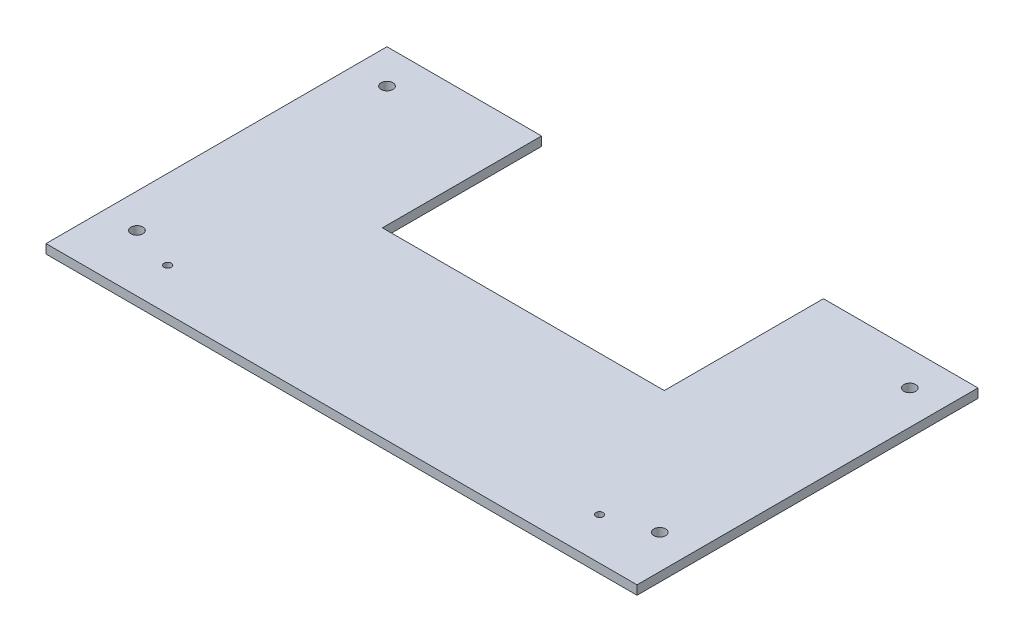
ISO-10303-21;
HEADER;
FILE_DESCRIPTION(('STEP AP214'),'2;1');
FILE_NAME('part.step','',(''),(''),'','','');
FILE_SCHEMA(('AUTOMOTIVE_DESIGN { 1 0 10303 214 1 1 1 1 }'));
ENDSEC;
DATA;
#1=APPLICATION_CONTEXT('core data for automotive mechanical design processes');
#2=APPLICATION_PROTOCOL_DEFINITION('international standard','automotive_design',2000,#1);
#3=PRODUCT_CONTEXT('',#1,'mechanical');
#4=PRODUCT('Part','Part','',(#3));
#5=PRODUCT_RELATED_PRODUCT_CATEGORY('part','',(#4));
#6=PRODUCT_DEFINITION_FORMATION('','',#4);
#7=PRODUCT_DEFINITION_CONTEXT('part definition',#1,'design');
#8=PRODUCT_DEFINITION('design','',#6,#7);
#9=PRODUCT_DEFINITION_SHAPE('','',#8);
#10=(LENGTH_UNIT() NAMED_UNIT(*) SI_UNIT(.MILLI.,.METRE.));
#11=(NAMED_UNIT(*) PLANE_ANGLE_UNIT() SI_UNIT($,.RADIAN.));
#12=(NAMED_UNIT(*) SI_UNIT($,.STERADIAN.) SOLID_ANGLE_UNIT());
#13=UNCERTAINTY_MEASURE_WITH_UNIT(LENGTH_MEASURE(1.E-05),#10,'distance_accuracy_value','');
#14=(GEOMETRIC_REPRESENTATION_CONTEXT(3) GLOBAL_UNCERTAINTY_ASSIGNED_CONTEXT((#13)) GLOBAL_UNIT_ASSIGNED_CONTEXT((#10,
#11,#12)) REPRESENTATION_CONTEXT('',''));
#15=CARTESIAN_POINT('',(0.,0.,0.));
#16=DIRECTION('',(0.,0.,1.));
#17=DIRECTION('',(1.,0.,0.));
#18=AXIS2_PLACEMENT_3D('',#15,#16,#17);
#19=CARTESIAN_POINT('',(-130.,4.,-75.));
#20=DIRECTION('',(0.,0.,1.));
#21=DIRECTION('',(1.,0.,0.));
#22=AXIS2_PLACEMENT_3D('',#19,#20,#21);
#23=PLANE('',#22);
#24=DIRECTION('',(-1.,0.,0.));
#25=VECTOR('',#24,1.);
#26=CARTESIAN_POINT('',(-130.,4.,-75.));
#27=LINE('',#26,#25);
#28=CARTESIAN_POINT('',(-62.,4.,-75.));
#29=VERTEX_POINT('',#28);
#30=CARTESIAN_POINT('',(-130.,4.,-75.));
#31=VERTEX_POINT('',#30);
#32=EDGE_CURVE('E163',#29,#31,#27,.T.);
#33=ORIENTED_EDGE('',*,*,#32,.F.);
#34=DIRECTION('',(0.,1.,0.));
#35=VECTOR('',#34,1.);
#36=CARTESIAN_POINT('',(-62.,0.,-75.));
#37=LINE('',#36,#35);
#38=CARTESIAN_POINT('',(-62.,0.,-75.));
#39=VERTEX_POINT('',#38);
#40=EDGE_CURVE('E155',#39,#29,#37,.T.);
#41=ORIENTED_EDGE('',*,*,#40,.F.);
#42=DIRECTION('',(-1.,0.,0.));
#43=VECTOR('',#42,1.);
#44=CARTESIAN_POINT('',(-130.,0.,-75.));
#45=LINE('',#44,#43);
#46=CARTESIAN_POINT('',(-130.,0.,-75.));
#47=VERTEX_POINT('',#46);
#48=EDGE_CURVE('E142',#39,#47,#45,.T.);
#49=ORIENTED_EDGE('',*,*,#48,.T.);
#50=DIRECTION('',(0.,-1.,0.));
#51=VECTOR('',#50,1.);
#52=CARTESIAN_POINT('',(-130.,4.,-75.));
#53=LINE('',#52,#51);
#54=EDGE_CURVE('E54',#31,#47,#53,.T.);
#55=ORIENTED_EDGE('',*,*,#54,.F.);
#56=EDGE_LOOP('',(#33,#41,#49,#55));
#57=FACE_BOUND('',#56,.T.);
#58=ADVANCED_FACE('F45',(#57),#23,.F.);
#59=CARTESIAN_POINT('',(130.,4.,75.));
#60=DIRECTION('',(-1.,0.,0.));
#61=DIRECTION('',(0.,0.,1.));
#62=AXIS2_PLACEMENT_3D('',#59,#60,#61);
#63=PLANE('',#62);
#64=DIRECTION('',(0.,0.,-1.));
#65=VECTOR('',#64,1.);
#66=CARTESIAN_POINT('',(130.,0.,75.));
#67=LINE('',#66,#65);
#68=CARTESIAN_POINT('',(130.,0.,75.));
#69=VERTEX_POINT('',#68);
#70=CARTESIAN_POINT('',(130.,0.,-75.));
#71=VERTEX_POINT('',#70);
#72=EDGE_CURVE('E157',#69,#71,#67,.T.);
#73=ORIENTED_EDGE('',*,*,#72,.T.);
#74=DIRECTION('',(0.,-1.,0.));
#75=VECTOR('',#74,1.);
#76=CARTESIAN_POINT('',(130.,4.,-75.));
#77=LINE('',#76,#75);
#78=CARTESIAN_POINT('',(130.,4.,-75.));
#79=VERTEX_POINT('',#78);
#80=EDGE_CURVE('E11',#79,#71,#77,.T.);
#81=ORIENTED_EDGE('',*,*,#80,.F.);
#82=DIRECTION('',(0.,0.,-1.));
#83=VECTOR('',#82,1.);
#84=CARTESIAN_POINT('',(130.,4.,75.));
#85=LINE('',#84,#83);
#86=CARTESIAN_POINT('',(130.,4.,75.));
#87=VERTEX_POINT('',#86);
#88=EDGE_CURVE('E161',#87,#79,#85,.T.);
#89=ORIENTED_EDGE('',*,*,#88,.F.);
#90=DIRECTION('',(0.,-1.,0.));
#91=VECTOR('',#90,1.);
#92=CARTESIAN_POINT('',(130.,4.,75.));
#93=LINE('',#92,#91);
#94=EDGE_CURVE('E168',#87,#69,#93,.T.);
#95=ORIENTED_EDGE('',*,*,#94,.T.);
#96=EDGE_LOOP('',(#73,#81,#89,#95));
#97=FACE_BOUND('',#96,.T.);
#98=ADVANCED_FACE('F47',(#97),#63,.F.);
#99=CARTESIAN_POINT('',(62.,0.,-75.));
#100=VERTEX_POINT('',#99);
#101=EDGE_CURVE('E171',#71,#100,#45,.T.);
#102=ORIENTED_EDGE('',*,*,#101,.T.);
#103=DIRECTION('',(0.,1.,0.));
#104=VECTOR('',#103,1.);
#105=CARTESIAN_POINT('',(62.,0.,-75.));
#106=LINE('',#105,#104);
#107=CARTESIAN_POINT('',(62.,4.,-75.));
#108=VERTEX_POINT('',#107);
#109=EDGE_CURVE('E158',#100,#108,#106,.T.);
#110=ORIENTED_EDGE('',*,*,#109,.T.);
#111=EDGE_CURVE('E99',#79,#108,#27,.T.);
#112=ORIENTED_EDGE('',*,*,#111,.F.);
#113=ORIENTED_EDGE('',*,*,#80,.T.);
#114=EDGE_LOOP('',(#102,#110,#112,#113));
#115=FACE_BOUND('',#114,.T.);
#116=ADVANCED_FACE('F238',(#115),#23,.F.);
#117=CARTESIAN_POINT('',(-130.,4.,75.));
#118=DIRECTION('',(1.,0.,0.));
#119=DIRECTION('',(0.,0.,-1.));
#120=AXIS2_PLACEMENT_3D('',#117,#118,#119);
#121=PLANE('',#120);
#122=DIRECTION('',(0.,0.,1.));
#123=VECTOR('',#122,1.);
#124=CARTESIAN_POINT('',(-130.,0.,75.));
#125=LINE('',#124,#123);
#126=CARTESIAN_POINT('',(-130.,0.,75.));
#127=VERTEX_POINT('',#126);
#128=EDGE_CURVE('E174',#47,#127,#125,.T.);
#129=ORIENTED_EDGE('',*,*,#128,.T.);
#130=DIRECTION('',(0.,-1.,0.));
#131=VECTOR('',#130,1.);
#132=CARTESIAN_POINT('',(-130.,4.,75.));
#133=LINE('',#132,#131);
#134=CARTESIAN_POINT('',(-130.,4.,75.));
#135=VERTEX_POINT('',#134);
#136=EDGE_CURVE('E178',#135,#127,#133,.T.);
#137=ORIENTED_EDGE('',*,*,#136,.F.);
#138=DIRECTION('',(0.,0.,1.));
#139=VECTOR('',#138,1.);
#140=CARTESIAN_POINT('',(-130.,4.,75.));
#141=LINE('',#140,#139);
#142=EDGE_CURVE('E165',#31,#135,#141,.T.);
#143=ORIENTED_EDGE('',*,*,#142,.F.);
#144=ORIENTED_EDGE('',*,*,#54,.T.);
#145=EDGE_LOOP('',(#129,#137,#143,#144));
#146=FACE_BOUND('',#145,.T.);
#147=ADVANCED_FACE('F247',(#146),#121,.F.);
#148=CARTESIAN_POINT('',(-130.,4.,75.));
#149=DIRECTION('',(0.,0.,-1.));
#150=DIRECTION('',(-1.,0.,0.));
#151=AXIS2_PLACEMENT_3D('',#148,#149,#150);
#152=PLANE('',#151);
#153=DIRECTION('',(1.,0.,0.));
#154=VECTOR('',#153,1.);
#155=CARTESIAN_POINT('',(-130.,0.,75.));
#156=LINE('',#155,#154);
#157=EDGE_CURVE('E92',#127,#69,#156,.T.);
#158=ORIENTED_EDGE('',*,*,#157,.T.);
#159=ORIENTED_EDGE('',*,*,#94,.F.);
#160=DIRECTION('',(1.,0.,0.));
#161=VECTOR('',#160,1.);
#162=CARTESIAN_POINT('',(-130.,4.,75.));
#163=LINE('',#162,#161);
#164=EDGE_CURVE('E71',#135,#87,#163,.T.);
#165=ORIENTED_EDGE('',*,*,#164,.F.);
#166=ORIENTED_EDGE('',*,*,#136,.T.);
#167=EDGE_LOOP('',(#158,#159,#165,#166));
#168=FACE_BOUND('',#167,.T.);
#169=ADVANCED_FACE('F252',(#168),#152,.F.);
#170=CARTESIAN_POINT('',(0.,4.,0.));
#171=DIRECTION('',(0.,-1.,0.));
#172=DIRECTION('',(0.,0.,-1.));
#173=AXIS2_PLACEMENT_3D('',#170,#171,#172);
#174=PLANE('',#173);
#175=CARTESIAN_POINT('',(94.9999999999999,4.,56.5));
#176=DIRECTION('',(0.,1.,0.));
#177=DIRECTION('',(0.,0.,1.));
#178=AXIS2_PLACEMENT_3D('',#175,#176,#177);
#179=CIRCLE('',#178,1.60000000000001);
#180=CARTESIAN_POINT('',(94.9999999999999,4.,58.1));
#181=VERTEX_POINT('',#180);
#182=EDGE_CURVE('E183',#181,#181,#179,.T.);
#183=ORIENTED_EDGE('',*,*,#182,.F.);
#184=EDGE_LOOP('',(#183));
#185=FACE_BOUND('',#184,.T.);
#186=CARTESIAN_POINT('',(-95.0000000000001,4.,56.5000000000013));
#187=DIRECTION('',(0.,1.,0.));
#188=DIRECTION('',(0.,0.,1.));
#189=AXIS2_PLACEMENT_3D('',#186,#187,#188);
#190=CIRCLE('',#189,1.60000000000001);
#191=CARTESIAN_POINT('',(-95.0000000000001,4.,58.1000000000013));
#192=VERTEX_POINT('',#191);
#193=EDGE_CURVE('E188',#192,#192,#190,.T.);
#194=ORIENTED_EDGE('',*,*,#193,.F.);
#195=EDGE_LOOP('',(#194));
#196=FACE_BOUND('',#195,.T.);
#197=CARTESIAN_POINT('',(-114.999999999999,4.,50.));
#198=DIRECTION('',(0.,1.,0.));
#199=DIRECTION('',(0.,0.,1.));
#200=AXIS2_PLACEMENT_3D('',#197,#198,#199);
#201=CIRCLE('',#200,2.59999999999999);
#202=CARTESIAN_POINT('',(-114.999999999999,4.,52.6));
#203=VERTEX_POINT('',#202);
#204=EDGE_CURVE('E211',#203,#203,#201,.T.);
#205=ORIENTED_EDGE('',*,*,#204,.F.);
#206=EDGE_LOOP('',(#205));
#207=FACE_BOUND('',#206,.T.);
#208=CARTESIAN_POINT('',(115.000000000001,4.,50.));
#209=DIRECTION('',(0.,1.,0.));
#210=DIRECTION('',(0.,0.,1.));
#211=AXIS2_PLACEMENT_3D('',#208,#209,#210);
#212=CIRCLE('',#211,2.59999999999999);
#213=CARTESIAN_POINT('',(115.000000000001,4.,52.6));
#214=VERTEX_POINT('',#213);
#215=EDGE_CURVE('E206',#214,#214,#212,.T.);
#216=ORIENTED_EDGE('',*,*,#215,.F.);
#217=EDGE_LOOP('',(#216));
#218=FACE_BOUND('',#217,.T.);
#219=CARTESIAN_POINT('',(115.,4.,-60.));
#220=DIRECTION('',(0.,1.,0.));
#221=DIRECTION('',(0.,0.,1.));
#222=AXIS2_PLACEMENT_3D('',#219,#220,#221);
#223=CIRCLE('',#222,2.59999999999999);
#224=CARTESIAN_POINT('',(115.,4.,-57.4));
#225=VERTEX_POINT('',#224);
#226=EDGE_CURVE('E200',#225,#225,#223,.T.);
#227=ORIENTED_EDGE('',*,*,#226,.F.);
#228=EDGE_LOOP('',(#227));
#229=FACE_BOUND('',#228,.T.);
#230=CARTESIAN_POINT('',(-115.,4.,-60.));
#231=DIRECTION('',(0.,1.,0.));
#232=DIRECTION('',(0.,0.,1.));
#233=AXIS2_PLACEMENT_3D('',#230,#231,#232);
#234=CIRCLE('',#233,2.59999999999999);
#235=CARTESIAN_POINT('',(-115.,4.,-57.4));
#236=VERTEX_POINT('',#235);
#237=EDGE_CURVE('E153',#236,#236,#234,.T.);
#238=ORIENTED_EDGE('',*,*,#237,.F.);
#239=EDGE_LOOP('',(#238));
#240=FACE_BOUND('',#239,.T.);
#241=DIRECTION('',(1.,0.,0.));
#242=VECTOR('',#241,1.);
#243=CARTESIAN_POINT('',(-62.,4.,-4.99999999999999));
#244=LINE('',#243,#242);
#245=CARTESIAN_POINT('',(-62.,4.,-4.99999999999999));
#246=VERTEX_POINT('',#245);
#247=CARTESIAN_POINT('',(62.,4.,-4.99999999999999));
#248=VERTEX_POINT('',#247);
#249=EDGE_CURVE('E145',#246,#248,#244,.T.);
#250=ORIENTED_EDGE('',*,*,#249,.F.);
#251=DIRECTION('',(0.,0.,1.));
#252=VECTOR('',#251,1.);
#253=CARTESIAN_POINT('',(-62.,4.,-4.99999999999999));
#254=LINE('',#253,#252);
#255=EDGE_CURVE('E128',#29,#246,#254,.T.);
#256=ORIENTED_EDGE('',*,*,#255,.F.);
#257=ORIENTED_EDGE('',*,*,#32,.T.);
#258=ORIENTED_EDGE('',*,*,#142,.T.);
#259=ORIENTED_EDGE('',*,*,#164,.T.);
#260=ORIENTED_EDGE('',*,*,#88,.T.);
#261=ORIENTED_EDGE('',*,*,#111,.T.);
#262=DIRECTION('',(0.,0.,-1.));
#263=VECTOR('',#262,1.);
#264=CARTESIAN_POINT('',(62.,4.,-4.99999999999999));
#265=LINE('',#264,#263);
#266=EDGE_CURVE('E143',#248,#108,#265,.T.);
#267=ORIENTED_EDGE('',*,*,#266,.F.);
#268=EDGE_LOOP('',(#250,#256,#257,#258,#259,#260,#261,#267));
#269=FACE_BOUND('',#268,.T.);
#270=ADVANCED_FACE('F260',(#185,#196,#207,#218,#229,#240,#269),#174,.F.);
#271=CARTESIAN_POINT('',(0.,0.,0.));
#272=DIRECTION('',(0.,-1.,0.));
#273=DIRECTION('',(0.,0.,-1.));
#274=AXIS2_PLACEMENT_3D('',#271,#272,#273);
#275=PLANE('',#274);
#276=CARTESIAN_POINT('',(94.9999999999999,0.,56.5));
#277=DIRECTION('',(0.,-1.,0.));
#278=DIRECTION('',(0.,0.,-1.));
#279=AXIS2_PLACEMENT_3D('',#276,#277,#278);
#280=CIRCLE('',#279,1.60000000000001);
#281=CARTESIAN_POINT('',(94.9999999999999,0.,54.9));
#282=VERTEX_POINT('',#281);
#283=EDGE_CURVE('E49',#282,#282,#280,.T.);
#284=ORIENTED_EDGE('',*,*,#283,.F.);
#285=EDGE_LOOP('',(#284));
#286=FACE_BOUND('',#285,.T.);
#287=CARTESIAN_POINT('',(-95.0000000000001,0.,56.5000000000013));
#288=DIRECTION('',(0.,-1.,0.));
#289=DIRECTION('',(0.,0.,-1.));
#290=AXIS2_PLACEMENT_3D('',#287,#288,#289);
#291=CIRCLE('',#290,1.60000000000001);
#292=CARTESIAN_POINT('',(-95.0000000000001,0.,54.9000000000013));
#293=VERTEX_POINT('',#292);
#294=EDGE_CURVE('E181',#293,#293,#291,.T.);
#295=ORIENTED_EDGE('',*,*,#294,.F.);
#296=EDGE_LOOP('',(#295));
#297=FACE_BOUND('',#296,.T.);
#298=CARTESIAN_POINT('',(-114.999999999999,0.,50.));
#299=DIRECTION('',(0.,1.,0.));
#300=DIRECTION('',(0.,0.,1.));
#301=AXIS2_PLACEMENT_3D('',#298,#299,#300);
#302=CIRCLE('',#301,2.59999999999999);
#303=CARTESIAN_POINT('',(-114.999999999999,0.,52.6));
#304=VERTEX_POINT('',#303);
#305=EDGE_CURVE('E148',#304,#304,#302,.T.);
#306=ORIENTED_EDGE('',*,*,#305,.T.);
#307=EDGE_LOOP('',(#306));
#308=FACE_BOUND('',#307,.T.);
#309=CARTESIAN_POINT('',(115.000000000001,0.,50.));
#310=DIRECTION('',(0.,1.,0.));
#311=DIRECTION('',(0.,0.,1.));
#312=AXIS2_PLACEMENT_3D('',#309,#310,#311);
#313=CIRCLE('',#312,2.59999999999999);
#314=CARTESIAN_POINT('',(115.000000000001,0.,52.6));
#315=VERTEX_POINT('',#314);
#316=EDGE_CURVE('E209',#315,#315,#313,.T.);
#317=ORIENTED_EDGE('',*,*,#316,.T.);
#318=EDGE_LOOP('',(#317));
#319=FACE_BOUND('',#318,.T.);
#320=CARTESIAN_POINT('',(115.,0.,-60.));
#321=DIRECTION('',(0.,1.,0.));
#322=DIRECTION('',(0.,0.,1.));
#323=AXIS2_PLACEMENT_3D('',#320,#321,#322);
#324=CIRCLE('',#323,2.59999999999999);
#325=CARTESIAN_POINT('',(115.,0.,-57.4));
#326=VERTEX_POINT('',#325);
#327=EDGE_CURVE('E203',#326,#326,#324,.T.);
#328=ORIENTED_EDGE('',*,*,#327,.T.);
#329=EDGE_LOOP('',(#328));
#330=FACE_BOUND('',#329,.T.);
#331=CARTESIAN_POINT('',(-115.,0.,-60.));
#332=DIRECTION('',(0.,1.,0.));
#333=DIRECTION('',(0.,0.,1.));
#334=AXIS2_PLACEMENT_3D('',#331,#332,#333);
#335=CIRCLE('',#334,2.59999999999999);
#336=CARTESIAN_POINT('',(-115.,0.,-57.4));
#337=VERTEX_POINT('',#336);
#338=EDGE_CURVE('E197',#337,#337,#335,.T.);
#339=ORIENTED_EDGE('',*,*,#338,.T.);
#340=EDGE_LOOP('',(#339));
#341=FACE_BOUND('',#340,.T.);
#342=DIRECTION('',(0.,0.,1.));
#343=VECTOR('',#342,1.);
#344=CARTESIAN_POINT('',(-62.,0.,-4.99999999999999));
#345=LINE('',#344,#343);
#346=CARTESIAN_POINT('',(-62.,0.,-4.99999999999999));
#347=VERTEX_POINT('',#346);
#348=EDGE_CURVE('E125',#39,#347,#345,.T.);
#349=ORIENTED_EDGE('',*,*,#348,.T.);
#350=DIRECTION('',(1.,0.,0.));
#351=VECTOR('',#350,1.);
#352=CARTESIAN_POINT('',(-62.,0.,-4.99999999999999));
#353=LINE('',#352,#351);
#354=CARTESIAN_POINT('',(62.,0.,-4.99999999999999));
#355=VERTEX_POINT('',#354);
#356=EDGE_CURVE('E135',#347,#355,#353,.T.);
#357=ORIENTED_EDGE('',*,*,#356,.T.);
#358=DIRECTION('',(0.,0.,-1.));
#359=VECTOR('',#358,1.);
#360=CARTESIAN_POINT('',(62.,0.,-4.99999999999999));
#361=LINE('',#360,#359);
#362=EDGE_CURVE('E62',#355,#100,#361,.T.);
#363=ORIENTED_EDGE('',*,*,#362,.T.);
#364=ORIENTED_EDGE('',*,*,#101,.F.);
#365=ORIENTED_EDGE('',*,*,#72,.F.);
#366=ORIENTED_EDGE('',*,*,#157,.F.);
#367=ORIENTED_EDGE('',*,*,#128,.F.);
#368=ORIENTED_EDGE('',*,*,#48,.F.);
#369=EDGE_LOOP('',(#349,#357,#363,#364,#365,#366,#367,#368));
#370=FACE_BOUND('',#369,.T.);
#371=ADVANCED_FACE('F140',(#286,#297,#308,#319,#330,#341,#370),#275,.T.);
#372=CARTESIAN_POINT('',(-62.,0.,-4.99999999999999));
#373=DIRECTION('',(-1.,0.,0.));
#374=DIRECTION('',(0.,0.,1.));
#375=AXIS2_PLACEMENT_3D('',#372,#373,#374);
#376=PLANE('',#375);
#377=ORIENTED_EDGE('',*,*,#255,.T.);
#378=DIRECTION('',(0.,1.,0.));
#379=VECTOR('',#378,1.);
#380=CARTESIAN_POINT('',(-62.,0.,-4.99999999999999));
#381=LINE('',#380,#379);
#382=EDGE_CURVE('E121',#347,#246,#381,.T.);
#383=ORIENTED_EDGE('',*,*,#382,.F.);
#384=ORIENTED_EDGE('',*,*,#348,.F.);
#385=ORIENTED_EDGE('',*,*,#40,.T.);
#386=EDGE_LOOP('',(#377,#383,#384,#385));
#387=FACE_BOUND('',#386,.T.);
#388=ADVANCED_FACE('F123',(#387),#376,.F.);
#389=CARTESIAN_POINT('',(62.,0.,-4.99999999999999));
#390=DIRECTION('',(1.,0.,0.));
#391=DIRECTION('',(0.,0.,-1.));
#392=AXIS2_PLACEMENT_3D('',#389,#390,#391);
#393=PLANE('',#392);
#394=ORIENTED_EDGE('',*,*,#266,.T.);
#395=ORIENTED_EDGE('',*,*,#109,.F.);
#396=ORIENTED_EDGE('',*,*,#362,.F.);
#397=DIRECTION('',(0.,1.,0.));
#398=VECTOR('',#397,1.);
#399=CARTESIAN_POINT('',(62.,0.,-4.99999999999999));
#400=LINE('',#399,#398);
#401=EDGE_CURVE('E132',#355,#248,#400,.T.);
#402=ORIENTED_EDGE('',*,*,#401,.T.);
#403=EDGE_LOOP('',(#394,#395,#396,#402));
#404=FACE_BOUND('',#403,.T.);
#405=ADVANCED_FACE('F262',(#404),#393,.F.);
#406=CARTESIAN_POINT('',(-62.,0.,-4.99999999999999));
#407=DIRECTION('',(0.,0.,1.));
#408=DIRECTION('',(1.,0.,0.));
#409=AXIS2_PLACEMENT_3D('',#406,#407,#408);
#410=PLANE('',#409);
#411=ORIENTED_EDGE('',*,*,#249,.T.);
#412=ORIENTED_EDGE('',*,*,#401,.F.);
#413=ORIENTED_EDGE('',*,*,#356,.F.);
#414=ORIENTED_EDGE('',*,*,#382,.T.);
#415=EDGE_LOOP('',(#411,#412,#413,#414));
#416=FACE_BOUND('',#415,.T.);
#417=ADVANCED_FACE('F136',(#416),#410,.F.);
#418=CARTESIAN_POINT('',(-115.,0.,-60.));
#419=DIRECTION('',(0.,1.,0.));
#420=DIRECTION('',(0.,0.,1.));
#421=AXIS2_PLACEMENT_3D('',#418,#419,#420);
#422=CYLINDRICAL_SURFACE('',#421,2.59999999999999);
#423=ORIENTED_EDGE('',*,*,#338,.F.);
#424=EDGE_LOOP('',(#423));
#425=FACE_BOUND('',#424,.T.);
#426=ORIENTED_EDGE('',*,*,#237,.T.);
#427=EDGE_LOOP('',(#426));
#428=FACE_BOUND('',#427,.T.);
#429=ADVANCED_FACE('F267',(#425,#428),#422,.F.);
#430=CARTESIAN_POINT('',(115.,0.,-60.));
#431=DIRECTION('',(0.,1.,0.));
#432=DIRECTION('',(0.,0.,1.));
#433=AXIS2_PLACEMENT_3D('',#430,#431,#432);
#434=CYLINDRICAL_SURFACE('',#433,2.59999999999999);
#435=ORIENTED_EDGE('',*,*,#327,.F.);
#436=EDGE_LOOP('',(#435));
#437=FACE_BOUND('',#436,.T.);
#438=ORIENTED_EDGE('',*,*,#226,.T.);
#439=EDGE_LOOP('',(#438));
#440=FACE_BOUND('',#439,.T.);
#441=ADVANCED_FACE('F232',(#437,#440),#434,.F.);
#442=CARTESIAN_POINT('',(115.000000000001,0.,50.));
#443=DIRECTION('',(0.,1.,0.));
#444=DIRECTION('',(0.,0.,1.));
#445=AXIS2_PLACEMENT_3D('',#442,#443,#444);
#446=CYLINDRICAL_SURFACE('',#445,2.59999999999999);
#447=ORIENTED_EDGE('',*,*,#316,.F.);
#448=EDGE_LOOP('',(#447));
#449=FACE_BOUND('',#448,.T.);
#450=ORIENTED_EDGE('',*,*,#215,.T.);
#451=EDGE_LOOP('',(#450));
#452=FACE_BOUND('',#451,.T.);
#453=ADVANCED_FACE('F223',(#449,#452),#446,.F.);
#454=CARTESIAN_POINT('',(-114.999999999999,0.,50.));
#455=DIRECTION('',(0.,1.,0.));
#456=DIRECTION('',(0.,0.,1.));
#457=AXIS2_PLACEMENT_3D('',#454,#455,#456);
#458=CYLINDRICAL_SURFACE('',#457,2.59999999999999);
#459=ORIENTED_EDGE('',*,*,#305,.F.);
#460=EDGE_LOOP('',(#459));
#461=FACE_BOUND('',#460,.T.);
#462=ORIENTED_EDGE('',*,*,#204,.T.);
#463=EDGE_LOOP('',(#462));
#464=FACE_BOUND('',#463,.T.);
#465=ADVANCED_FACE('F220',(#461,#464),#458,.F.);
#466=CARTESIAN_POINT('',(-95.0000000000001,-6.,56.5000000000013));
#467=DIRECTION('',(0.,1.,0.));
#468=DIRECTION('',(0.,0.,1.));
#469=AXIS2_PLACEMENT_3D('',#466,#467,#468);
#470=CYLINDRICAL_SURFACE('',#469,1.60000000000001);
#471=ORIENTED_EDGE('',*,*,#294,.T.);
#472=EDGE_LOOP('',(#471));
#473=FACE_BOUND('',#472,.T.);
#474=ORIENTED_EDGE('',*,*,#193,.T.);
#475=EDGE_LOOP('',(#474));
#476=FACE_BOUND('',#475,.T.);
#477=ADVANCED_FACE('F222',(#473,#476),#470,.F.);
#478=CARTESIAN_POINT('',(94.9999999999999,-6.,56.5));
#479=DIRECTION('',(0.,1.,0.));
#480=DIRECTION('',(0.,0.,1.));
#481=AXIS2_PLACEMENT_3D('',#478,#479,#480);
#482=CYLINDRICAL_SURFACE('',#481,1.60000000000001);
#483=ORIENTED_EDGE('',*,*,#283,.T.);
#484=EDGE_LOOP('',(#483));
#485=FACE_BOUND('',#484,.T.);
#486=ORIENTED_EDGE('',*,*,#182,.T.);
#487=EDGE_LOOP('',(#486));
#488=FACE_BOUND('',#487,.T.);
#489=ADVANCED_FACE('F230',(#485,#488),#482,.F.);
#490=CLOSED_SHELL('',(#58,#98,#116,#147,#169,#270,#371,#388,#405,#417,#429,#441,#453,#465,#477,#489));
#491=MANIFOLD_SOLID_BREP('B2',#490);
#492=ADVANCED_BREP_SHAPE_REPRESENTATION('',(#18,#491),#14);
#493=SHAPE_DEFINITION_REPRESENTATION(#9,#492);
ENDSEC;
END-ISO-10303-21;
